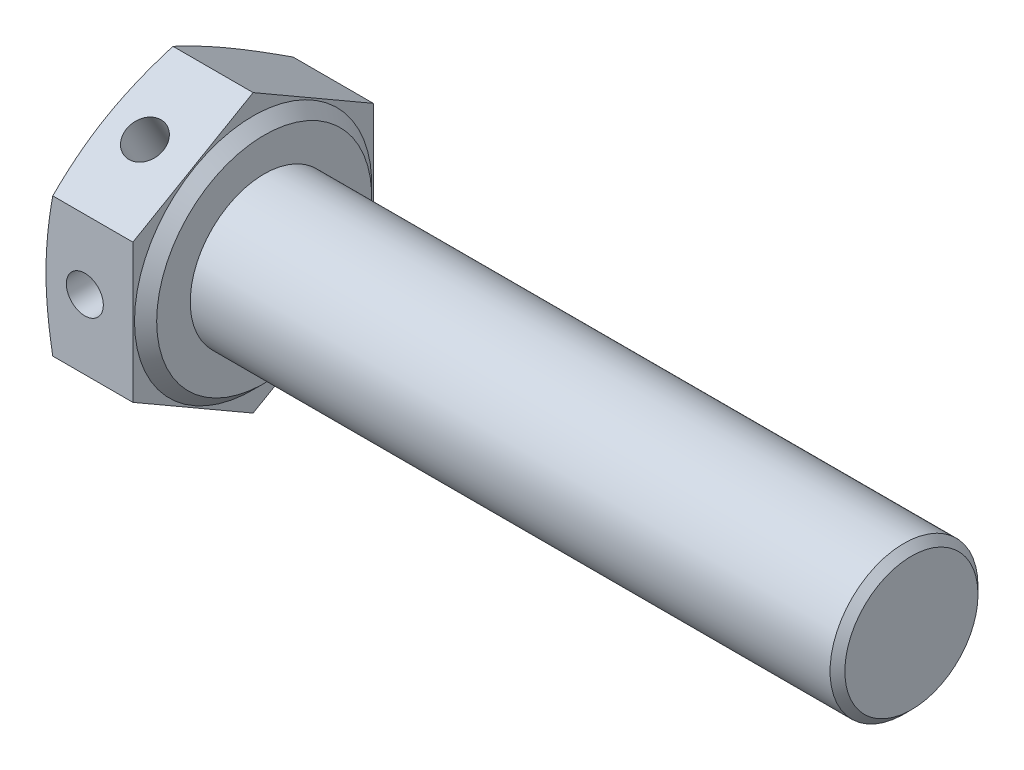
ISO-10303-21;
HEADER;
FILE_DESCRIPTION(('STEP AP214'),'2;1');
FILE_NAME('part.step','',(''),(''),'','','');
FILE_SCHEMA(('AUTOMOTIVE_DESIGN { 1 0 10303 214 1 1 1 1 }'));
ENDSEC;
DATA;
#1=APPLICATION_CONTEXT('core data for automotive mechanical design processes');
#2=APPLICATION_PROTOCOL_DEFINITION('international standard','automotive_design',2000,#1);
#3=PRODUCT_CONTEXT('',#1,'mechanical');
#4=PRODUCT('Part','Part','',(#3));
#5=PRODUCT_RELATED_PRODUCT_CATEGORY('part','',(#4));
#6=PRODUCT_DEFINITION_FORMATION('','',#4);
#7=PRODUCT_DEFINITION_CONTEXT('part definition',#1,'design');
#8=PRODUCT_DEFINITION('design','',#6,#7);
#9=PRODUCT_DEFINITION_SHAPE('','',#8);
#10=(LENGTH_UNIT() NAMED_UNIT(*) SI_UNIT(.MILLI.,.METRE.));
#11=(NAMED_UNIT(*) PLANE_ANGLE_UNIT() SI_UNIT($,.RADIAN.));
#12=(NAMED_UNIT(*) SI_UNIT($,.STERADIAN.) SOLID_ANGLE_UNIT());
#13=UNCERTAINTY_MEASURE_WITH_UNIT(LENGTH_MEASURE(1.E-05),#10,'distance_accuracy_value','');
#14=(GEOMETRIC_REPRESENTATION_CONTEXT(3) GLOBAL_UNCERTAINTY_ASSIGNED_CONTEXT((#13)) GLOBAL_UNIT_ASSIGNED_CONTEXT((#10,
#11,#12)) REPRESENTATION_CONTEXT('',''));
#15=CARTESIAN_POINT('',(0.,0.,0.));
#16=DIRECTION('',(0.,0.,1.));
#17=DIRECTION('',(1.,0.,0.));
#18=AXIS2_PLACEMENT_3D('',#15,#16,#17);
#19=CARTESIAN_POINT('',(2.1,0.,-6.50000000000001));
#20=DIRECTION('',(0.,0.,1.));
#21=DIRECTION('',(1.,0.,0.));
#22=AXIS2_PLACEMENT_3D('',#19,#20,#21);
#23=CYLINDRICAL_SURFACE('',#22,1.);
#24=CARTESIAN_POINT('',(2.1,0.,6.50000000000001));
#25=DIRECTION('',(0.,0.,1.));
#26=DIRECTION('',(1.,0.,0.));
#27=AXIS2_PLACEMENT_3D('',#24,#25,#26);
#28=CIRCLE('',#27,1.);
#29=CARTESIAN_POINT('',(3.1,0.,6.50000000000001));
#30=VERTEX_POINT('',#29);
#31=EDGE_CURVE('E330',#30,#30,#28,.T.);
#32=ORIENTED_EDGE('',*,*,#31,.T.);
#33=EDGE_LOOP('',(#32));
#34=FACE_BOUND('',#33,.T.);
#35=CARTESIAN_POINT('',(2.1,0.,0.));
#36=DIRECTION('',(0.,-0.866025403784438,0.500000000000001));
#37=DIRECTION('',(0.,0.500000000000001,0.866025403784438));
#38=AXIS2_PLACEMENT_3D('',#35,#36,#37);
#39=ELLIPSE('',#38,2.,1.);
#40=CARTESIAN_POINT('',(1.1,0.,0.));
#41=VERTEX_POINT('',#40);
#42=CARTESIAN_POINT('',(3.1,0.,0.));
#43=VERTEX_POINT('',#42);
#44=EDGE_CURVE('E50',#41,#43,#39,.F.);
#45=ORIENTED_EDGE('',*,*,#44,.T.);
#46=CARTESIAN_POINT('',(2.1,0.,0.));
#47=DIRECTION('',(0.,0.500000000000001,0.866025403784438));
#48=DIRECTION('',(0.,-0.866025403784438,0.500000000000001));
#49=AXIS2_PLACEMENT_3D('',#46,#47,#48);
#50=ELLIPSE('',#49,1.15470053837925,1.);
#51=EDGE_CURVE('E11',#43,#41,#50,.F.);
#52=ORIENTED_EDGE('',*,*,#51,.T.);
#53=EDGE_LOOP('',(#45,#52));
#54=FACE_BOUND('',#53,.T.);
#55=ADVANCED_FACE('F37',(#34,#54),#23,.F.);
#56=CARTESIAN_POINT('',(5.3,-7.50555349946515,0.));
#57=DIRECTION('',(1.,0.,0.));
#58=DIRECTION('',(0.,0.,-1.));
#59=AXIS2_PLACEMENT_3D('',#56,#57,#58);
#60=PLANE('',#59);
#61=CARTESIAN_POINT('',(5.3,0.,0.));
#62=DIRECTION('',(-1.,0.,0.));
#63=DIRECTION('',(0.,0.,1.));
#64=AXIS2_PLACEMENT_3D('',#61,#62,#63);
#65=CIRCLE('',#64,5.815);
#66=CARTESIAN_POINT('',(5.3,0.,5.815));
#67=VERTEX_POINT('',#66);
#68=EDGE_CURVE('E169',#67,#67,#65,.T.);
#69=ORIENTED_EDGE('',*,*,#68,.F.);
#70=EDGE_LOOP('',(#69));
#71=FACE_BOUND('',#70,.T.);
#72=CARTESIAN_POINT('',(5.3,0.,0.));
#73=DIRECTION('',(1.,0.,0.));
#74=DIRECTION('',(0.,0.,-1.));
#75=AXIS2_PLACEMENT_3D('',#72,#73,#74);
#76=CIRCLE('',#75,4.);
#77=CARTESIAN_POINT('',(5.3,0.,-4.));
#78=VERTEX_POINT('',#77);
#79=EDGE_CURVE('E325',#78,#78,#76,.T.);
#80=ORIENTED_EDGE('',*,*,#79,.F.);
#81=EDGE_LOOP('',(#80));
#82=FACE_BOUND('',#81,.T.);
#83=ADVANCED_FACE('F212',(#71,#82),#60,.T.);
#84=CARTESIAN_POINT('',(5.3,-3.75277674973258,6.50000000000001));
#85=DIRECTION('',(0.,0.866025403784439,-0.5));
#86=DIRECTION('',(0.,0.5,0.866025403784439));
#87=AXIS2_PLACEMENT_3D('',#84,#85,#86);
#88=PLANE('',#87);
#89=CARTESIAN_POINT('',(0.366033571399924,-7.50566896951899,-0.000199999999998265));
#90=CARTESIAN_POINT('',(0.30944402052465,-7.35024872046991,0.268995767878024));
#91=CARTESIAN_POINT('',(0.257966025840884,-7.19431596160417,0.539079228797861));
#92=CARTESIAN_POINT('',(0.167398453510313,-6.88143655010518,1.08100226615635));
#93=CARTESIAN_POINT('',(0.128318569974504,-6.72448920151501,1.35284304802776));
#94=CARTESIAN_POINT('',(0.0651079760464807,-6.41132237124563,1.89526390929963));
#95=CARTESIAN_POINT('',(0.0408393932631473,-6.25511004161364,2.16583160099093));
#96=CARTESIAN_POINT('',(0.00828840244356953,-5.94232007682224,2.70759971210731));
#97=CARTESIAN_POINT('',(0.,-5.78574260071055,2.97879985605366));
#98=CARTESIAN_POINT('',(0.,-5.47258764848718,3.52120014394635));
#99=CARTESIAN_POINT('',(0.00828840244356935,-5.31601017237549,3.7924002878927));
#100=CARTESIAN_POINT('',(0.040839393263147,-5.00322020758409,4.33416839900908));
#101=CARTESIAN_POINT('',(0.0651079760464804,-4.8470078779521,4.60473609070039));
#102=CARTESIAN_POINT('',(0.128318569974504,-4.53384104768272,5.14715695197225));
#103=CARTESIAN_POINT('',(0.167398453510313,-4.37689369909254,5.41899773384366));
#104=CARTESIAN_POINT('',(0.257966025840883,-4.06401428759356,5.96092077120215));
#105=CARTESIAN_POINT('',(0.30944402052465,-3.90808152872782,6.23100423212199));
#106=CARTESIAN_POINT('',(0.366033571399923,-3.75266127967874,6.50020000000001));
#107=B_SPLINE_CURVE_WITH_KNOTS('',3,(#89,#90,#91,#92,#93,#94,#95,#96,#97,#98,#99,#100,#101,#102,
#103,#104,#105,#106),.UNSPECIFIED.,.F.,.F.,(4,2,2,2,2,2,2,2,4),(0.,0.947946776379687,
1.89663293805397,2.83634783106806,3.775710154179,4.71507247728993,5.65478737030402,
6.60347353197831,7.551420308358),.UNSPECIFIED.);
#108=CARTESIAN_POINT('',(0.365991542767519,-7.50555349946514,0.));
#109=VERTEX_POINT('',#108);
#110=CARTESIAN_POINT('',(0.,-5.62916512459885,3.25));
#111=VERTEX_POINT('',#110);
#112=EDGE_CURVE('E221',#109,#111,#107,.T.);
#113=ORIENTED_EDGE('',*,*,#112,.F.);
#114=DIRECTION('',(-1.,0.,0.));
#115=VECTOR('',#114,1.);
#116=CARTESIAN_POINT('',(5.3,-7.50555349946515,0.));
#117=LINE('',#116,#115);
#118=CARTESIAN_POINT('',(4.7,-7.50555349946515,0.));
#119=VERTEX_POINT('',#118);
#120=EDGE_CURVE('E141',#119,#109,#117,.T.);
#121=ORIENTED_EDGE('',*,*,#120,.F.);
#122=DIRECTION('',(0.,-0.5,-0.866025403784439));
#123=VECTOR('',#122,1.);
#124=CARTESIAN_POINT('',(4.7,-3.75277674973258,6.50000000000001));
#125=LINE('',#124,#123);
#126=CARTESIAN_POINT('',(4.7,-3.75277674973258,6.50000000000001));
#127=VERTEX_POINT('',#126);
#128=EDGE_CURVE('E159',#127,#119,#125,.T.);
#129=ORIENTED_EDGE('',*,*,#128,.F.);
#130=DIRECTION('',(-1.,0.,0.));
#131=VECTOR('',#130,1.);
#132=CARTESIAN_POINT('',(5.3,-3.75277674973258,6.50000000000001));
#133=LINE('',#132,#131);
#134=CARTESIAN_POINT('',(0.365991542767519,-3.75277674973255,6.50000000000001));
#135=VERTEX_POINT('',#134);
#136=EDGE_CURVE('E156',#127,#135,#133,.T.);
#137=ORIENTED_EDGE('',*,*,#136,.T.);
#138=EDGE_CURVE('E215',#111,#135,#107,.T.);
#139=ORIENTED_EDGE('',*,*,#138,.F.);
#140=EDGE_LOOP('',(#113,#121,#129,#137,#139));
#141=FACE_BOUND('',#140,.T.);
#142=ADVANCED_FACE('F208',(#141),#88,.F.);
#143=CARTESIAN_POINT('',(5.3,-7.50555349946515,0.));
#144=DIRECTION('',(0.,0.866025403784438,0.5));
#145=DIRECTION('',(0.,-0.5,0.866025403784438));
#146=AXIS2_PLACEMENT_3D('',#143,#144,#145);
#147=PLANE('',#146);
#148=CARTESIAN_POINT('',(2.1,-5.62916512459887,-3.24999999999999));
#149=DIRECTION('',(0.,0.866025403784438,0.5));
#150=DIRECTION('',(0.,-0.5,0.866025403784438));
#151=AXIS2_PLACEMENT_3D('',#148,#149,#150);
#152=CIRCLE('',#151,1.);
#153=CARTESIAN_POINT('',(2.1,-6.12916512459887,-2.38397459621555));
#154=VERTEX_POINT('',#153);
#155=EDGE_CURVE('E334',#154,#154,#152,.T.);
#156=ORIENTED_EDGE('',*,*,#155,.T.);
#157=EDGE_LOOP('',(#156));
#158=FACE_BOUND('',#157,.T.);
#159=CARTESIAN_POINT('',(0.366033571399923,-3.75266127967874,-6.50020000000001));
#160=CARTESIAN_POINT('',(0.30944402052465,-3.90808152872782,-6.23100423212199));
#161=CARTESIAN_POINT('',(0.257966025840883,-4.06401428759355,-5.96092077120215));
#162=CARTESIAN_POINT('',(0.167398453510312,-4.37689369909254,-5.41899773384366));
#163=CARTESIAN_POINT('',(0.128318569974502,-4.53384104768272,-5.14715695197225));
#164=CARTESIAN_POINT('',(0.0651079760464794,-4.8470078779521,-4.60473609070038));
#165=CARTESIAN_POINT('',(0.0408393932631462,-5.00322020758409,-4.33416839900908));
#166=CARTESIAN_POINT('',(0.00828840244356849,-5.31601017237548,-3.7924002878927));
#167=CARTESIAN_POINT('',(0.,-5.47258764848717,-3.52120014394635));
#168=CARTESIAN_POINT('',(0.,-5.78574260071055,-2.97879985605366));
#169=CARTESIAN_POINT('',(0.00828840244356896,-5.94232007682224,-2.70759971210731));
#170=CARTESIAN_POINT('',(0.040839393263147,-6.25511004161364,-2.16583160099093));
#171=CARTESIAN_POINT('',(0.0651079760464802,-6.41132237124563,-1.89526390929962));
#172=CARTESIAN_POINT('',(0.128318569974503,-6.72448920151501,-1.35284304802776));
#173=CARTESIAN_POINT('',(0.167398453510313,-6.88143655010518,-1.08100226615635));
#174=CARTESIAN_POINT('',(0.257966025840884,-7.19431596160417,-0.539079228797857));
#175=CARTESIAN_POINT('',(0.309444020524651,-7.35024872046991,-0.268995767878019));
#176=CARTESIAN_POINT('',(0.366033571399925,-7.50566896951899,0.000200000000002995));
#177=B_SPLINE_CURVE_WITH_KNOTS('',3,(#159,#160,#161,#162,#163,#164,#165,#166,#167,#168,#169,
#170,#171,#172,#173,#174,#175,#176),.UNSPECIFIED.,.F.,.F.,(4,2,2,2,2,2,2,2,4),(0.,
0.947946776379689,1.89663293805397,2.83634783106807,3.775710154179,4.71507247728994,
5.65478737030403,6.60347353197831,7.551420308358),.UNSPECIFIED.);
#178=CARTESIAN_POINT('',(0.365991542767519,-3.75277674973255,-6.50000000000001));
#179=VERTEX_POINT('',#178);
#180=CARTESIAN_POINT('',(0.,-5.62916512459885,-3.25));
#181=VERTEX_POINT('',#180);
#182=EDGE_CURVE('E233',#179,#181,#177,.T.);
#183=ORIENTED_EDGE('',*,*,#182,.F.);
#184=DIRECTION('',(-1.,0.,0.));
#185=VECTOR('',#184,1.);
#186=CARTESIAN_POINT('',(5.3,-3.75277674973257,-6.50000000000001));
#187=LINE('',#186,#185);
#188=CARTESIAN_POINT('',(4.7,-3.75277674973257,-6.50000000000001));
#189=VERTEX_POINT('',#188);
#190=EDGE_CURVE('E144',#189,#179,#187,.T.);
#191=ORIENTED_EDGE('',*,*,#190,.F.);
#192=DIRECTION('',(0.,0.5,-0.866025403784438));
#193=VECTOR('',#192,1.);
#194=CARTESIAN_POINT('',(4.7,-7.50555349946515,0.));
#195=LINE('',#194,#193);
#196=EDGE_CURVE('E161',#119,#189,#195,.T.);
#197=ORIENTED_EDGE('',*,*,#196,.F.);
#198=ORIENTED_EDGE('',*,*,#120,.T.);
#199=EDGE_CURVE('E186',#181,#109,#177,.T.);
#200=ORIENTED_EDGE('',*,*,#199,.F.);
#201=EDGE_LOOP('',(#183,#191,#197,#198,#200));
#202=FACE_BOUND('',#201,.T.);
#203=ADVANCED_FACE('F202',(#158,#202),#147,.F.);
#204=CARTESIAN_POINT('',(5.3,-3.75277674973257,-6.50000000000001));
#205=DIRECTION('',(0.,0.,1.));
#206=DIRECTION('',(0.,-1.,0.));
#207=AXIS2_PLACEMENT_3D('',#204,#205,#206);
#208=PLANE('',#207);
#209=CARTESIAN_POINT('',(2.1,0.,-6.50000000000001));
#210=DIRECTION('',(0.,0.,1.));
#211=DIRECTION('',(1.,0.,0.));
#212=AXIS2_PLACEMENT_3D('',#209,#210,#211);
#213=CIRCLE('',#212,1.);
#214=CARTESIAN_POINT('',(3.1,0.,-6.50000000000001));
#215=VERTEX_POINT('',#214);
#216=EDGE_CURVE('E327',#215,#215,#213,.T.);
#217=ORIENTED_EDGE('',*,*,#216,.T.);
#218=EDGE_LOOP('',(#217));
#219=FACE_BOUND('',#218,.T.);
#220=CARTESIAN_POINT('',(1.9557136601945,-9.93603326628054,-6.50000000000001));
#221=CARTESIAN_POINT('',(1.86616534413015,-9.64194976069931,-6.50000000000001));
#222=CARTESIAN_POINT('',(1.77766194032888,-9.34754216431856,-6.50000000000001));
#223=CARTESIAN_POINT('',(1.60332300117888,-8.75791379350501,-6.50000000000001));
#224=CARTESIAN_POINT('',(1.51748767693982,-8.46269295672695,-6.50000000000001));
#225=CARTESIAN_POINT('',(1.34892015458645,-7.87076780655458,-6.50000000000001));
#226=CARTESIAN_POINT('',(1.26619404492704,-7.57406175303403,-6.50000000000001));
#227=CARTESIAN_POINT('',(1.10481344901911,-6.97954593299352,-6.50000000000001));
#228=CARTESIAN_POINT('',(1.02615888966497,-6.68173618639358,-6.50000000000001));
#229=CARTESIAN_POINT('',(0.87486821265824,-6.08849459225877,-6.50000000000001));
#230=CARTESIAN_POINT('',(0.802169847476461,-5.79307869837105,-6.50000000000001));
#231=CARTESIAN_POINT('',(0.662962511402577,-5.20077688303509,-6.50000000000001));
#232=CARTESIAN_POINT('',(0.596453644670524,-4.90389093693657,-6.50000000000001));
#233=CARTESIAN_POINT('',(0.471175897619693,-4.30858258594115,-6.50000000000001));
#234=CARTESIAN_POINT('',(0.412404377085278,-4.01016074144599,-6.50000000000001));
#235=CARTESIAN_POINT('',(0.304390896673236,-3.41158450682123,-6.50000000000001));
#236=CARTESIAN_POINT('',(0.255148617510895,-3.11143017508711,-6.50000000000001));
#237=CARTESIAN_POINT('',(0.173069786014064,-2.54318752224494,-6.50000000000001));
#238=CARTESIAN_POINT('',(0.139012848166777,-2.27527713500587,-6.50000000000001));
#239=CARTESIAN_POINT('',(0.0813625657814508,-1.73832350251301,-6.50000000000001));
#240=CARTESIAN_POINT('',(0.0577689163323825,-1.46928029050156,-6.50000000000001));
#241=CARTESIAN_POINT('',(0.0221814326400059,-0.930606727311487,-6.50000000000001));
#242=CARTESIAN_POINT('',(0.0101793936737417,-0.660976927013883,-6.50000000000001));
#243=CARTESIAN_POINT('',(-0.00161720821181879,-0.121447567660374,-6.50000000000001));
#244=CARTESIAN_POINT('',(-0.00141185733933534,0.148451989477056,-6.50000000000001));
#245=CARTESIAN_POINT('',(0.0112271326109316,0.689329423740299,-6.50000000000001));
#246=CARTESIAN_POINT('',(0.0237227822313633,0.960305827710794,-6.50000000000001));
#247=CARTESIAN_POINT('',(0.0603673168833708,1.50146271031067,-6.50000000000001));
#248=CARTESIAN_POINT('',(0.0845164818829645,1.77164316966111,-6.50000000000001));
#249=CARTESIAN_POINT('',(0.143338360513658,2.31107475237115,-6.50000000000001));
#250=CARTESIAN_POINT('',(0.17802011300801,2.58032487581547,-6.50000000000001));
#251=CARTESIAN_POINT('',(0.256500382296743,3.11747812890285,-6.50000000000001));
#252=CARTESIAN_POINT('',(0.300298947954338,3.38538125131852,-6.50000000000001));
#253=CARTESIAN_POINT('',(0.398107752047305,3.93393829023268,-6.50000000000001));
#254=CARTESIAN_POINT('',(0.452535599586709,4.21451708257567,-6.50000000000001));
#255=CARTESIAN_POINT('',(0.568396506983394,4.77423382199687,-6.50000000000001));
#256=CARTESIAN_POINT('',(0.629830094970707,5.05337165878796,-6.50000000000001));
#257=CARTESIAN_POINT('',(0.758412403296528,5.61040543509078,-6.50000000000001));
#258=CARTESIAN_POINT('',(0.825562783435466,5.88830098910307,-6.50000000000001));
#259=CARTESIAN_POINT('',(0.964486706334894,6.44292134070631,-6.50000000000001));
#260=CARTESIAN_POINT('',(1.03626013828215,6.71964616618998,-6.50000000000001));
#261=CARTESIAN_POINT('',(1.18365887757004,7.27244360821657,-6.50000000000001));
#262=CARTESIAN_POINT('',(1.25928899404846,7.54851493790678,-6.50000000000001));
#263=CARTESIAN_POINT('',(1.41363071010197,8.09979648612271,-6.50000000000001));
#264=CARTESIAN_POINT('',(1.49234235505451,8.37500669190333,-6.50000000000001));
#265=CARTESIAN_POINT('',(1.73221572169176,9.19944068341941,-6.50000000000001));
#266=CARTESIAN_POINT('',(1.89714307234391,9.74756811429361,-6.50000000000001));
#267=CARTESIAN_POINT('',(2.2320227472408,10.8356486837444,-6.50000000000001));
#268=CARTESIAN_POINT('',(2.40189951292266,11.3756252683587,-6.50000000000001));
#269=CARTESIAN_POINT('',(2.74647925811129,12.4540616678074,-6.50000000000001));
#270=CARTESIAN_POINT('',(2.92118246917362,12.9925214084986,-6.50000000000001));
#271=CARTESIAN_POINT('',(3.2734464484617,14.0662400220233,-6.50000000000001));
#272=CARTESIAN_POINT('',(3.45099385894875,14.6015032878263,-6.50000000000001));
#273=CARTESIAN_POINT('',(3.71928531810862,15.4037138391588,-6.50000000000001));
#274=CARTESIAN_POINT('',(3.80904053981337,15.6709925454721,-6.50000000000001));
#275=CARTESIAN_POINT('',(3.98913176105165,16.2053535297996,-6.50000000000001));
#276=CARTESIAN_POINT('',(4.07946775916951,16.4724358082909,-6.50000000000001));
#277=CARTESIAN_POINT('',(4.17005521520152,16.7394327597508,-6.50000000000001));
#278=B_SPLINE_CURVE_WITH_KNOTS('',3,(#220,#221,#222,#223,#224,#225,#226,#227,#228,#229,#230,
#231,#232,#233,#234,#235,#236,#237,#238,#239,#240,#241,#242,#243,#244,#245,#246,#247,#248,#249,
#250,#251,#252,#253,#254,#255,#256,#257,#258,#259,#260,#261,#262,#263,#264,#265,#266,#267,#268,
#269,#270,#271,#272,#273,#274,#275,#276,#277),.UNSPECIFIED.,.F.,.F.,(4,2,2,2,2,2,2,2,2,2,2,2,2,
2,2,2,2,2,2,2,2,2,2,2,2,2,2,2,4),(0.,0.922251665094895,1.84457611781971,2.76862139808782,
3.69265008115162,4.60528596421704,5.51793720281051,6.43027620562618,7.34258463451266,
8.15260590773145,8.96260357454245,9.77202749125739,10.5814456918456,11.3949688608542,
12.2085115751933,13.0227544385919,13.8370016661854,14.694319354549,15.5517017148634,
16.4093338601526,17.2669454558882,18.1256539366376,18.9843750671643,20.7015057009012,
22.3996829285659,24.0979417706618,25.7897568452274,26.6355962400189,27.4814335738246),.UNSPECIFIED.);
#279=CARTESIAN_POINT('',(0.365991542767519,3.75277674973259,-6.49999999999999));
#280=VERTEX_POINT('',#279);
#281=CARTESIAN_POINT('',(0.,0.,-6.5));
#282=VERTEX_POINT('',#281);
#283=EDGE_CURVE('E176',#280,#282,#278,.F.);
#284=ORIENTED_EDGE('',*,*,#283,.F.);
#285=DIRECTION('',(-1.,0.,0.));
#286=VECTOR('',#285,1.);
#287=CARTESIAN_POINT('',(5.3,3.75277674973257,-6.50000000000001));
#288=LINE('',#287,#286);
#289=CARTESIAN_POINT('',(4.7,3.75277674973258,-6.50000000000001));
#290=VERTEX_POINT('',#289);
#291=EDGE_CURVE('E147',#290,#280,#288,.T.);
#292=ORIENTED_EDGE('',*,*,#291,.F.);
#293=DIRECTION('',(0.,1.,0.));
#294=VECTOR('',#293,1.);
#295=CARTESIAN_POINT('',(4.7,-3.75277674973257,-6.50000000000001));
#296=LINE('',#295,#294);
#297=EDGE_CURVE('E163',#189,#290,#296,.T.);
#298=ORIENTED_EDGE('',*,*,#297,.F.);
#299=ORIENTED_EDGE('',*,*,#190,.T.);
#300=EDGE_CURVE('E177',#282,#179,#278,.F.);
#301=ORIENTED_EDGE('',*,*,#300,.F.);
#302=EDGE_LOOP('',(#284,#292,#298,#299,#301));
#303=FACE_BOUND('',#302,.T.);
#304=ADVANCED_FACE('F197',(#219,#303),#208,.F.);
#305=CARTESIAN_POINT('',(5.3,3.75277674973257,-6.50000000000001));
#306=DIRECTION('',(0.,-0.866025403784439,0.5));
#307=DIRECTION('',(0.,-0.5,-0.866025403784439));
#308=AXIS2_PLACEMENT_3D('',#305,#306,#307);
#309=PLANE('',#308);
#310=CARTESIAN_POINT('',(0.366033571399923,7.50566896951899,0.000199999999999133));
#311=CARTESIAN_POINT('',(0.30944402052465,7.3502487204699,-0.268995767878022));
#312=CARTESIAN_POINT('',(0.257966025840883,7.19431596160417,-0.53907922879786));
#313=CARTESIAN_POINT('',(0.167398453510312,6.88143655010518,-1.08100226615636));
#314=CARTESIAN_POINT('',(0.128318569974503,6.72448920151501,-1.35284304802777));
#315=CARTESIAN_POINT('',(0.0651079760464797,6.41132237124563,-1.89526390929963));
#316=CARTESIAN_POINT('',(0.0408393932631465,6.25511004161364,-2.16583160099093));
#317=CARTESIAN_POINT('',(0.00828840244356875,5.94232007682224,-2.70759971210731));
#318=CARTESIAN_POINT('',(0.,5.78574260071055,-2.97879985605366));
#319=CARTESIAN_POINT('',(0.,5.47258764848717,-3.52120014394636));
#320=CARTESIAN_POINT('',(0.00828840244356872,5.31601017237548,-3.7924002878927));
#321=CARTESIAN_POINT('',(0.0408393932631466,5.00322020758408,-4.33416839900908));
#322=CARTESIAN_POINT('',(0.0651079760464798,4.84700787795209,-4.60473609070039));
#323=CARTESIAN_POINT('',(0.128318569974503,4.53384104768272,-5.14715695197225));
#324=CARTESIAN_POINT('',(0.167398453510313,4.37689369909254,-5.41899773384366));
#325=CARTESIAN_POINT('',(0.257966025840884,4.06401428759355,-5.96092077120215));
#326=CARTESIAN_POINT('',(0.30944402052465,3.90808152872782,-6.23100423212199));
#327=CARTESIAN_POINT('',(0.366033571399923,3.75266127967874,-6.50020000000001));
#328=B_SPLINE_CURVE_WITH_KNOTS('',3,(#310,#311,#312,#313,#314,#315,#316,#317,#318,#319,#320,
#321,#322,#323,#324,#325,#326,#327),.UNSPECIFIED.,.F.,.F.,(4,2,2,2,2,2,2,2,4),(0.,
0.947946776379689,1.89663293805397,2.83634783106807,3.775710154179,4.71507247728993,
5.65478737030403,6.60347353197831,7.551420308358),.UNSPECIFIED.);
#329=CARTESIAN_POINT('',(0.365991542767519,7.50555349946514,0.));
#330=VERTEX_POINT('',#329);
#331=CARTESIAN_POINT('',(0.,5.62916512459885,-3.25));
#332=VERTEX_POINT('',#331);
#333=EDGE_CURVE('E58',#330,#332,#328,.T.);
#334=ORIENTED_EDGE('',*,*,#333,.F.);
#335=DIRECTION('',(-1.,0.,0.));
#336=VECTOR('',#335,1.);
#337=CARTESIAN_POINT('',(5.3,7.50555349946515,0.));
#338=LINE('',#337,#336);
#339=CARTESIAN_POINT('',(4.7,7.50555349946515,0.));
#340=VERTEX_POINT('',#339);
#341=EDGE_CURVE('E150',#340,#330,#338,.T.);
#342=ORIENTED_EDGE('',*,*,#341,.F.);
#343=DIRECTION('',(0.,0.5,0.866025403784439));
#344=VECTOR('',#343,1.);
#345=CARTESIAN_POINT('',(4.7,3.75277674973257,-6.50000000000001));
#346=LINE('',#345,#344);
#347=EDGE_CURVE('E165',#290,#340,#346,.T.);
#348=ORIENTED_EDGE('',*,*,#347,.F.);
#349=ORIENTED_EDGE('',*,*,#291,.T.);
#350=EDGE_CURVE('E185',#332,#280,#328,.T.);
#351=ORIENTED_EDGE('',*,*,#350,.F.);
#352=EDGE_LOOP('',(#334,#342,#348,#349,#351));
#353=FACE_BOUND('',#352,.T.);
#354=ADVANCED_FACE('F201',(#353),#309,.F.);
#355=CARTESIAN_POINT('',(5.3,7.50555349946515,0.));
#356=DIRECTION('',(0.,-0.866025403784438,-0.5));
#357=DIRECTION('',(0.,0.5,-0.866025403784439));
#358=AXIS2_PLACEMENT_3D('',#355,#356,#357);
#359=PLANE('',#358);
#360=CARTESIAN_POINT('',(2.1,5.62916512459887,3.24999999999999));
#361=DIRECTION('',(0.,-0.866025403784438,-0.5));
#362=DIRECTION('',(0.,0.5,-0.866025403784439));
#363=AXIS2_PLACEMENT_3D('',#360,#361,#362);
#364=CIRCLE('',#363,1.);
#365=CARTESIAN_POINT('',(2.1,6.12916512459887,2.38397459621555));
#366=VERTEX_POINT('',#365);
#367=EDGE_CURVE('E337',#366,#366,#364,.T.);
#368=ORIENTED_EDGE('',*,*,#367,.T.);
#369=EDGE_LOOP('',(#368));
#370=FACE_BOUND('',#369,.T.);
#371=CARTESIAN_POINT('',(0.366033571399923,3.75266127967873,6.50020000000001));
#372=CARTESIAN_POINT('',(0.309444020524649,3.90808152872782,6.23100423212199));
#373=CARTESIAN_POINT('',(0.257966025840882,4.06401428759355,5.96092077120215));
#374=CARTESIAN_POINT('',(0.167398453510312,4.37689369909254,5.41899773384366));
#375=CARTESIAN_POINT('',(0.128318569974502,4.53384104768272,5.14715695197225));
#376=CARTESIAN_POINT('',(0.065107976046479,4.84700787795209,4.60473609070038));
#377=CARTESIAN_POINT('',(0.0408393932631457,5.00322020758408,4.33416839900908));
#378=CARTESIAN_POINT('',(0.00828840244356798,5.31601017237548,3.7924002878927));
#379=CARTESIAN_POINT('',(0.,5.47258764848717,3.52120014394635));
#380=CARTESIAN_POINT('',(0.,5.78574260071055,2.97879985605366));
#381=CARTESIAN_POINT('',(0.0082884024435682,5.94232007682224,2.70759971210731));
#382=CARTESIAN_POINT('',(0.0408393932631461,6.25511004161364,2.16583160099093));
#383=CARTESIAN_POINT('',(0.0651079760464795,6.41132237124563,1.89526390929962));
#384=CARTESIAN_POINT('',(0.128318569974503,6.72448920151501,1.35284304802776));
#385=CARTESIAN_POINT('',(0.167398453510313,6.88143655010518,1.08100226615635));
#386=CARTESIAN_POINT('',(0.257966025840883,7.19431596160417,0.539079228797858));
#387=CARTESIAN_POINT('',(0.30944402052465,7.3502487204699,0.26899576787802));
#388=CARTESIAN_POINT('',(0.366033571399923,7.50566896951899,-0.000200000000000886));
#389=B_SPLINE_CURVE_WITH_KNOTS('',3,(#371,#372,#373,#374,#375,#376,#377,#378,#379,#380,#381,
#382,#383,#384,#385,#386,#387,#388),.UNSPECIFIED.,.F.,.F.,(4,2,2,2,2,2,2,2,4),(0.,
0.947946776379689,1.89663293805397,2.83634783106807,3.775710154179,4.71507247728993,
5.65478737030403,6.60347353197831,7.551420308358),.UNSPECIFIED.);
#390=CARTESIAN_POINT('',(0.365991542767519,3.75277674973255,6.50000000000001));
#391=VERTEX_POINT('',#390);
#392=CARTESIAN_POINT('',(0.,5.62916512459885,3.25));
#393=VERTEX_POINT('',#392);
#394=EDGE_CURVE('E222',#391,#393,#389,.T.);
#395=ORIENTED_EDGE('',*,*,#394,.F.);
#396=DIRECTION('',(-1.,0.,0.));
#397=VECTOR('',#396,1.);
#398=CARTESIAN_POINT('',(5.3,3.75277674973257,6.50000000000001));
#399=LINE('',#398,#397);
#400=CARTESIAN_POINT('',(4.7,3.75277674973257,6.50000000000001));
#401=VERTEX_POINT('',#400);
#402=EDGE_CURVE('E153',#401,#391,#399,.T.);
#403=ORIENTED_EDGE('',*,*,#402,.F.);
#404=DIRECTION('',(0.,-0.5,0.866025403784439));
#405=VECTOR('',#404,1.);
#406=CARTESIAN_POINT('',(4.7,7.50555349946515,0.));
#407=LINE('',#406,#405);
#408=EDGE_CURVE('E167',#340,#401,#407,.T.);
#409=ORIENTED_EDGE('',*,*,#408,.F.);
#410=ORIENTED_EDGE('',*,*,#341,.T.);
#411=EDGE_CURVE('E232',#393,#330,#389,.T.);
#412=ORIENTED_EDGE('',*,*,#411,.F.);
#413=EDGE_LOOP('',(#395,#403,#409,#410,#412));
#414=FACE_BOUND('',#413,.T.);
#415=ADVANCED_FACE('F283',(#370,#414),#359,.F.);
#416=CARTESIAN_POINT('',(5.3,3.75277674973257,6.50000000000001));
#417=DIRECTION('',(0.,0.,-1.));
#418=DIRECTION('',(0.,1.,0.));
#419=AXIS2_PLACEMENT_3D('',#416,#417,#418);
#420=PLANE('',#419);
#421=ORIENTED_EDGE('',*,*,#31,.F.);
#422=EDGE_LOOP('',(#421));
#423=FACE_BOUND('',#422,.T.);
#424=CARTESIAN_POINT('',(1.9557136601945,-9.93603326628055,6.50000000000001));
#425=CARTESIAN_POINT('',(1.86616534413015,-9.64194976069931,6.50000000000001));
#426=CARTESIAN_POINT('',(1.77766194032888,-9.34754216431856,6.50000000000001));
#427=CARTESIAN_POINT('',(1.60332300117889,-8.75791379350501,6.50000000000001));
#428=CARTESIAN_POINT('',(1.51748767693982,-8.46269295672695,6.50000000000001));
#429=CARTESIAN_POINT('',(1.34892015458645,-7.87076780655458,6.50000000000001));
#430=CARTESIAN_POINT('',(1.26619404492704,-7.57406175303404,6.50000000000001));
#431=CARTESIAN_POINT('',(1.10481344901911,-6.97954593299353,6.50000000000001));
#432=CARTESIAN_POINT('',(1.02615888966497,-6.68173618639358,6.50000000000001));
#433=CARTESIAN_POINT('',(0.874868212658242,-6.08849459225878,6.50000000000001));
#434=CARTESIAN_POINT('',(0.802169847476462,-5.79307869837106,6.50000000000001));
#435=CARTESIAN_POINT('',(0.662962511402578,-5.20077688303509,6.50000000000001));
#436=CARTESIAN_POINT('',(0.596453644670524,-4.90389093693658,6.50000000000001));
#437=CARTESIAN_POINT('',(0.471175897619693,-4.30858258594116,6.50000000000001));
#438=CARTESIAN_POINT('',(0.412404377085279,-4.010160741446,6.50000000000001));
#439=CARTESIAN_POINT('',(0.304390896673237,-3.41158450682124,6.50000000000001));
#440=CARTESIAN_POINT('',(0.255148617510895,-3.11143017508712,6.50000000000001));
#441=CARTESIAN_POINT('',(0.173069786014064,-2.54318752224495,6.50000000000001));
#442=CARTESIAN_POINT('',(0.139012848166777,-2.27527713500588,6.50000000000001));
#443=CARTESIAN_POINT('',(0.0813625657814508,-1.73832350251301,6.50000000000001));
#444=CARTESIAN_POINT('',(0.0577689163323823,-1.46928029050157,6.50000000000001));
#445=CARTESIAN_POINT('',(0.0221814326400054,-0.930606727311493,6.50000000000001));
#446=CARTESIAN_POINT('',(0.0101793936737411,-0.660976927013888,6.50000000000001));
#447=CARTESIAN_POINT('',(-0.00161720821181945,-0.121447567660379,6.50000000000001));
#448=CARTESIAN_POINT('',(-0.00141185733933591,0.148451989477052,6.50000000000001));
#449=CARTESIAN_POINT('',(0.0112271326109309,0.689329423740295,6.50000000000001));
#450=CARTESIAN_POINT('',(0.0237227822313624,0.96030582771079,6.50000000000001));
#451=CARTESIAN_POINT('',(0.0603673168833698,1.50146271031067,6.50000000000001));
#452=CARTESIAN_POINT('',(0.0845164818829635,1.7716431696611,6.50000000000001));
#453=CARTESIAN_POINT('',(0.143338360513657,2.31107475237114,6.50000000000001));
#454=CARTESIAN_POINT('',(0.178020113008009,2.58032487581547,6.50000000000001));
#455=CARTESIAN_POINT('',(0.256500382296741,3.11747812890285,6.50000000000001));
#456=CARTESIAN_POINT('',(0.300298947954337,3.38538125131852,6.50000000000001));
#457=CARTESIAN_POINT('',(0.398107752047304,3.93393829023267,6.50000000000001));
#458=CARTESIAN_POINT('',(0.452535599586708,4.21451708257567,6.50000000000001));
#459=CARTESIAN_POINT('',(0.568396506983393,4.77423382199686,6.50000000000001));
#460=CARTESIAN_POINT('',(0.629830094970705,5.05337165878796,6.50000000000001));
#461=CARTESIAN_POINT('',(0.758412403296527,5.61040543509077,6.50000000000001));
#462=CARTESIAN_POINT('',(0.825562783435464,5.88830098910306,6.50000000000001));
#463=CARTESIAN_POINT('',(0.964486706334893,6.44292134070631,6.50000000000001));
#464=CARTESIAN_POINT('',(1.03626013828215,6.71964616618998,6.50000000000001));
#465=CARTESIAN_POINT('',(1.18365887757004,7.27244360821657,6.50000000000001));
#466=CARTESIAN_POINT('',(1.25928899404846,7.54851493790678,6.50000000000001));
#467=CARTESIAN_POINT('',(1.41363071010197,8.0997964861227,6.50000000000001));
#468=CARTESIAN_POINT('',(1.49234235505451,8.37500669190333,6.50000000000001));
#469=CARTESIAN_POINT('',(1.73221572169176,9.19944068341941,6.50000000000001));
#470=CARTESIAN_POINT('',(1.89714307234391,9.7475681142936,6.50000000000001));
#471=CARTESIAN_POINT('',(2.2320227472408,10.8356486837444,6.50000000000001));
#472=CARTESIAN_POINT('',(2.40189951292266,11.3756252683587,6.50000000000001));
#473=CARTESIAN_POINT('',(2.74647925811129,12.4540616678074,6.50000000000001));
#474=CARTESIAN_POINT('',(2.92118246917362,12.9925214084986,6.50000000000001));
#475=CARTESIAN_POINT('',(3.2734464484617,14.0662400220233,6.50000000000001));
#476=CARTESIAN_POINT('',(3.45099385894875,14.6015032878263,6.50000000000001));
#477=CARTESIAN_POINT('',(3.71928531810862,15.4037138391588,6.50000000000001));
#478=CARTESIAN_POINT('',(3.80904053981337,15.6709925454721,6.50000000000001));
#479=CARTESIAN_POINT('',(3.98913176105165,16.2053535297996,6.50000000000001));
#480=CARTESIAN_POINT('',(4.07946775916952,16.4724358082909,6.50000000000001));
#481=CARTESIAN_POINT('',(4.17005521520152,16.7394327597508,6.50000000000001));
#482=B_SPLINE_CURVE_WITH_KNOTS('',3,(#424,#425,#426,#427,#428,#429,#430,#431,#432,#433,#434,
#435,#436,#437,#438,#439,#440,#441,#442,#443,#444,#445,#446,#447,#448,#449,#450,#451,#452,#453,
#454,#455,#456,#457,#458,#459,#460,#461,#462,#463,#464,#465,#466,#467,#468,#469,#470,#471,#472,
#473,#474,#475,#476,#477,#478,#479,#480,#481),.UNSPECIFIED.,.F.,.F.,(4,2,2,2,2,2,2,2,2,2,2,2,2,
2,2,2,2,2,2,2,2,2,2,2,2,2,2,2,4),(0.,0.922251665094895,1.84457611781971,2.76862139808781,
3.69265008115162,4.60528596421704,5.51793720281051,6.43027620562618,7.34258463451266,
8.15260590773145,8.96260357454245,9.77202749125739,10.5814456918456,11.3949688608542,
12.2085115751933,13.0227544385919,13.8370016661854,14.694319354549,15.5517017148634,
16.4093338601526,17.2669454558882,18.1256539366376,18.9843750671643,20.7015057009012,
22.3996829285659,24.0979417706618,25.7897568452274,26.6355962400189,27.4814335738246),.UNSPECIFIED.);
#483=CARTESIAN_POINT('',(0.,0.,6.50000000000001));
#484=VERTEX_POINT('',#483);
#485=EDGE_CURVE('E264',#135,#484,#482,.T.);
#486=ORIENTED_EDGE('',*,*,#485,.F.);
#487=ORIENTED_EDGE('',*,*,#136,.F.);
#488=DIRECTION('',(0.,-1.,0.));
#489=VECTOR('',#488,1.);
#490=CARTESIAN_POINT('',(4.7,3.75277674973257,6.50000000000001));
#491=LINE('',#490,#489);
#492=EDGE_CURVE('E139',#401,#127,#491,.T.);
#493=ORIENTED_EDGE('',*,*,#492,.F.);
#494=ORIENTED_EDGE('',*,*,#402,.T.);
#495=EDGE_CURVE('E270',#484,#391,#482,.T.);
#496=ORIENTED_EDGE('',*,*,#495,.F.);
#497=EDGE_LOOP('',(#486,#487,#493,#494,#496));
#498=FACE_BOUND('',#497,.T.);
#499=ADVANCED_FACE('F268',(#423,#498),#420,.F.);
#500=CARTESIAN_POINT('',(4.7,6.41500000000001,0.));
#501=DIRECTION('',(1.,0.,0.));
#502=DIRECTION('',(0.,0.,-1.));
#503=AXIS2_PLACEMENT_3D('',#500,#501,#502);
#504=PLANE('',#503);
#505=CARTESIAN_POINT('',(4.7,0.,0.));
#506=DIRECTION('',(-1.,0.,0.));
#507=DIRECTION('',(0.,0.,1.));
#508=AXIS2_PLACEMENT_3D('',#505,#506,#507);
#509=CIRCLE('',#508,6.41500000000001);
#510=CARTESIAN_POINT('',(4.7,0.,6.41500000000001));
#511=VERTEX_POINT('',#510);
#512=EDGE_CURVE('E173',#511,#511,#509,.T.);
#513=ORIENTED_EDGE('',*,*,#512,.T.);
#514=EDGE_LOOP('',(#513));
#515=FACE_BOUND('',#514,.T.);
#516=ORIENTED_EDGE('',*,*,#128,.T.);
#517=ORIENTED_EDGE('',*,*,#196,.T.);
#518=ORIENTED_EDGE('',*,*,#297,.T.);
#519=ORIENTED_EDGE('',*,*,#347,.T.);
#520=ORIENTED_EDGE('',*,*,#408,.T.);
#521=ORIENTED_EDGE('',*,*,#492,.T.);
#522=EDGE_LOOP('',(#516,#517,#518,#519,#520,#521));
#523=FACE_BOUND('',#522,.T.);
#524=ADVANCED_FACE('F282',(#515,#523),#504,.T.);
#525=CARTESIAN_POINT('',(4.7,0.,0.));
#526=DIRECTION('',(-1.,0.,0.));
#527=DIRECTION('',(0.,0.,1.));
#528=AXIS2_PLACEMENT_3D('',#525,#526,#527);
#529=CONICAL_SURFACE('',#528,6.41500000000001,0.785398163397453);
#530=ORIENTED_EDGE('',*,*,#68,.T.);
#531=EDGE_LOOP('',(#530));
#532=FACE_BOUND('',#531,.T.);
#533=ORIENTED_EDGE('',*,*,#512,.F.);
#534=EDGE_LOOP('',(#533));
#535=FACE_BOUND('',#534,.T.);
#536=ADVANCED_FACE('F459',(#532,#535),#529,.T.);
#537=CARTESIAN_POINT('',(0.,0.,0.));
#538=DIRECTION('',(1.,0.,0.));
#539=DIRECTION('',(0.,0.,-1.));
#540=AXIS2_PLACEMENT_3D('',#537,#538,#539);
#541=CONICAL_SURFACE('',#540,6.5,1.22173047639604);
#542=ORIENTED_EDGE('',*,*,#300,.T.);
#543=ORIENTED_EDGE('',*,*,#182,.T.);
#544=CARTESIAN_POINT('',(0.,0.,0.));
#545=DIRECTION('',(1.,0.,0.));
#546=DIRECTION('',(0.,0.,-1.));
#547=AXIS2_PLACEMENT_3D('',#544,#545,#546);
#548=CIRCLE('',#547,6.5);
#549=EDGE_CURVE('E135',#181,#282,#548,.T.);
#550=ORIENTED_EDGE('',*,*,#549,.T.);
#551=EDGE_LOOP('',(#542,#543,#550));
#552=FACE_BOUND('',#551,.T.);
#553=ADVANCED_FACE('F241',(#552),#541,.T.);
#554=ORIENTED_EDGE('',*,*,#199,.T.);
#555=ORIENTED_EDGE('',*,*,#112,.T.);
#556=EDGE_CURVE('E138',#111,#181,#548,.T.);
#557=ORIENTED_EDGE('',*,*,#556,.T.);
#558=EDGE_LOOP('',(#554,#555,#557));
#559=FACE_BOUND('',#558,.T.);
#560=ADVANCED_FACE('F256',(#559),#541,.T.);
#561=ORIENTED_EDGE('',*,*,#138,.T.);
#562=ORIENTED_EDGE('',*,*,#485,.T.);
#563=EDGE_CURVE('E266',#484,#111,#548,.T.);
#564=ORIENTED_EDGE('',*,*,#563,.T.);
#565=EDGE_LOOP('',(#561,#562,#564));
#566=FACE_BOUND('',#565,.T.);
#567=ADVANCED_FACE('F263',(#566),#541,.T.);
#568=ORIENTED_EDGE('',*,*,#394,.T.);
#569=CARTESIAN_POINT('',(0.,0.,0.));
#570=DIRECTION('',(-1.,0.,0.));
#571=DIRECTION('',(0.,0.,1.));
#572=AXIS2_PLACEMENT_3D('',#569,#570,#571);
#573=CIRCLE('',#572,6.5);
#574=EDGE_CURVE('E271',#484,#393,#573,.T.);
#575=ORIENTED_EDGE('',*,*,#574,.F.);
#576=ORIENTED_EDGE('',*,*,#495,.T.);
#577=EDGE_LOOP('',(#568,#575,#576));
#578=FACE_BOUND('',#577,.T.);
#579=ADVANCED_FACE('F422',(#578),#541,.T.);
#580=ORIENTED_EDGE('',*,*,#333,.T.);
#581=EDGE_CURVE('E499',#332,#393,#548,.T.);
#582=ORIENTED_EDGE('',*,*,#581,.T.);
#583=ORIENTED_EDGE('',*,*,#411,.T.);
#584=EDGE_LOOP('',(#580,#582,#583));
#585=FACE_BOUND('',#584,.T.);
#586=ADVANCED_FACE('F421',(#585),#541,.T.);
#587=ORIENTED_EDGE('',*,*,#283,.T.);
#588=EDGE_CURVE('E134',#282,#332,#548,.T.);
#589=ORIENTED_EDGE('',*,*,#588,.T.);
#590=ORIENTED_EDGE('',*,*,#350,.T.);
#591=EDGE_LOOP('',(#587,#589,#590));
#592=FACE_BOUND('',#591,.T.);
#593=ADVANCED_FACE('F193',(#592),#541,.T.);
#594=CARTESIAN_POINT('',(0.,-7.50555349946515,0.));
#595=DIRECTION('',(1.,0.,0.));
#596=DIRECTION('',(0.,0.,-1.));
#597=AXIS2_PLACEMENT_3D('',#594,#595,#596);
#598=PLANE('',#597);
#599=ORIENTED_EDGE('',*,*,#588,.F.);
#600=ORIENTED_EDGE('',*,*,#549,.F.);
#601=ORIENTED_EDGE('',*,*,#556,.F.);
#602=ORIENTED_EDGE('',*,*,#563,.F.);
#603=ORIENTED_EDGE('',*,*,#574,.T.);
#604=ORIENTED_EDGE('',*,*,#581,.F.);
#605=EDGE_LOOP('',(#599,#600,#601,#602,#603,#604));
#606=FACE_BOUND('',#605,.T.);
#607=ADVANCED_FACE('F249',(#606),#598,.F.);
#608=CARTESIAN_POINT('',(40.3,0.,0.));
#609=DIRECTION('',(-1.,0.,0.));
#610=DIRECTION('',(0.,0.,1.));
#611=AXIS2_PLACEMENT_3D('',#608,#609,#610);
#612=CYLINDRICAL_SURFACE('',#611,4.);
#613=CARTESIAN_POINT('',(39.9,0.,0.));
#614=DIRECTION('',(1.,0.,0.));
#615=DIRECTION('',(0.,0.,-1.));
#616=AXIS2_PLACEMENT_3D('',#613,#614,#615);
#617=CIRCLE('',#616,4.);
#618=CARTESIAN_POINT('',(39.9,0.,-4.));
#619=VERTEX_POINT('',#618);
#620=EDGE_CURVE('E124',#619,#619,#617,.F.);
#621=ORIENTED_EDGE('',*,*,#620,.T.);
#622=EDGE_LOOP('',(#621));
#623=FACE_BOUND('',#622,.T.);
#624=ORIENTED_EDGE('',*,*,#79,.T.);
#625=EDGE_LOOP('',(#624));
#626=FACE_BOUND('',#625,.T.);
#627=ADVANCED_FACE('F315',(#623,#626),#612,.T.);
#628=CARTESIAN_POINT('',(40.3,0.,0.));
#629=DIRECTION('',(1.,0.,0.));
#630=DIRECTION('',(0.,0.,-1.));
#631=AXIS2_PLACEMENT_3D('',#628,#629,#630);
#632=PLANE('',#631);
#633=CARTESIAN_POINT('',(40.3,0.,0.));
#634=DIRECTION('',(1.,0.,0.));
#635=DIRECTION('',(0.,0.,-1.));
#636=AXIS2_PLACEMENT_3D('',#633,#634,#635);
#637=CIRCLE('',#636,3.59999999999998);
#638=CARTESIAN_POINT('',(40.3,0.,-3.59999999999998));
#639=VERTEX_POINT('',#638);
#640=EDGE_CURVE('E131',#639,#639,#637,.T.);
#641=ORIENTED_EDGE('',*,*,#640,.T.);
#642=EDGE_LOOP('',(#641));
#643=FACE_BOUND('',#642,.T.);
#644=ADVANCED_FACE('F310',(#643),#632,.T.);
#645=CARTESIAN_POINT('',(40.3,0.,0.));
#646=DIRECTION('',(-1.,0.,0.));
#647=DIRECTION('',(0.,0.,1.));
#648=AXIS2_PLACEMENT_3D('',#645,#646,#647);
#649=CONICAL_SURFACE('',#648,3.59999999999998,0.785398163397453);
#650=ORIENTED_EDGE('',*,*,#620,.F.);
#651=EDGE_LOOP('',(#650));
#652=FACE_BOUND('',#651,.T.);
#653=ORIENTED_EDGE('',*,*,#640,.F.);
#654=EDGE_LOOP('',(#653));
#655=FACE_BOUND('',#654,.T.);
#656=ADVANCED_FACE('F39',(#652,#655),#649,.T.);
#657=CARTESIAN_POINT('',(2.1,0.,0.));
#658=DIRECTION('',(0.,-0.866025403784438,0.500000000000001));
#659=DIRECTION('',(0.,0.500000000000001,0.866025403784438));
#660=AXIS2_PLACEMENT_3D('',#657,#658,#659);
#661=ELLIPSE('',#660,2.,1.);
#662=EDGE_CURVE('E115',#41,#43,#661,.T.);
#663=ORIENTED_EDGE('',*,*,#662,.T.);
#664=CARTESIAN_POINT('',(2.1,0.,0.));
#665=DIRECTION('',(0.,0.500000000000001,0.866025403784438));
#666=DIRECTION('',(0.,-0.866025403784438,0.500000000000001));
#667=AXIS2_PLACEMENT_3D('',#664,#665,#666);
#668=ELLIPSE('',#667,1.15470053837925,1.);
#669=EDGE_CURVE('E45',#43,#41,#668,.T.);
#670=ORIENTED_EDGE('',*,*,#669,.T.);
#671=EDGE_LOOP('',(#663,#670));
#672=FACE_BOUND('',#671,.T.);
#673=ORIENTED_EDGE('',*,*,#216,.F.);
#674=EDGE_LOOP('',(#673));
#675=FACE_BOUND('',#674,.T.);
#676=ADVANCED_FACE('F126',(#672,#675),#23,.F.);
#677=CARTESIAN_POINT('',(2.1,-8.4437476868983,-4.87499999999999));
#678=DIRECTION('',(0.,0.86602540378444,0.499999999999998));
#679=DIRECTION('',(0.,-0.499999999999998,0.86602540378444));
#680=AXIS2_PLACEMENT_3D('',#677,#678,#679);
#681=CYLINDRICAL_SURFACE('',#680,1.);
#682=ORIENTED_EDGE('',*,*,#44,.F.);
#683=ORIENTED_EDGE('',*,*,#669,.F.);
#684=EDGE_LOOP('',(#682,#683));
#685=FACE_BOUND('',#684,.T.);
#686=ORIENTED_EDGE('',*,*,#367,.F.);
#687=EDGE_LOOP('',(#686));
#688=FACE_BOUND('',#687,.T.);
#689=ADVANCED_FACE('F122',(#685,#688),#681,.F.);
#690=ORIENTED_EDGE('',*,*,#662,.F.);
#691=ORIENTED_EDGE('',*,*,#51,.F.);
#692=EDGE_LOOP('',(#690,#691));
#693=FACE_BOUND('',#692,.T.);
#694=ORIENTED_EDGE('',*,*,#155,.F.);
#695=EDGE_LOOP('',(#694));
#696=FACE_BOUND('',#695,.T.);
#697=ADVANCED_FACE('F116',(#693,#696),#681,.F.);
#698=CLOSED_SHELL('',(#55,#83,#142,#203,#304,#354,#415,#499,#524,#536,#553,#560,#567,#579,#586,
#593,#607,#627,#644,#656,#676,#689,#697));
#699=MANIFOLD_SOLID_BREP('B2',#698);
#700=ADVANCED_BREP_SHAPE_REPRESENTATION('',(#18,#699),#14);
#701=SHAPE_DEFINITION_REPRESENTATION(#9,#700);
ENDSEC;
END-ISO-10303-21;
